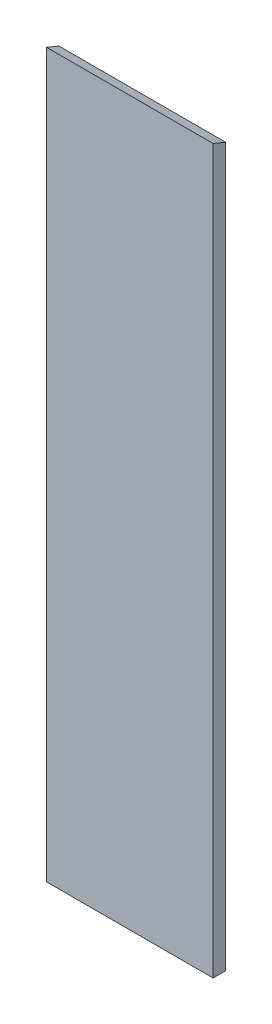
ISO-10303-21;
HEADER;
FILE_DESCRIPTION(('STEP AP214'),'2;1');
FILE_NAME('part.step','',(''),(''),'','','');
FILE_SCHEMA(('AUTOMOTIVE_DESIGN { 1 0 10303 214 1 1 1 1 }'));
ENDSEC;
DATA;
#1=APPLICATION_CONTEXT('core data for automotive mechanical design processes');
#2=APPLICATION_PROTOCOL_DEFINITION('international standard','automotive_design',2000,#1);
#3=PRODUCT_CONTEXT('',#1,'mechanical');
#4=PRODUCT('Part','Part','',(#3));
#5=PRODUCT_RELATED_PRODUCT_CATEGORY('part','',(#4));
#6=PRODUCT_DEFINITION_FORMATION('','',#4);
#7=PRODUCT_DEFINITION_CONTEXT('part definition',#1,'design');
#8=PRODUCT_DEFINITION('design','',#6,#7);
#9=PRODUCT_DEFINITION_SHAPE('','',#8);
#10=(LENGTH_UNIT() NAMED_UNIT(*) SI_UNIT(.MILLI.,.METRE.));
#11=(NAMED_UNIT(*) PLANE_ANGLE_UNIT() SI_UNIT($,.RADIAN.));
#12=(NAMED_UNIT(*) SI_UNIT($,.STERADIAN.) SOLID_ANGLE_UNIT());
#13=UNCERTAINTY_MEASURE_WITH_UNIT(LENGTH_MEASURE(1.E-05),#10,'distance_accuracy_value','');
#14=(GEOMETRIC_REPRESENTATION_CONTEXT(3) GLOBAL_UNCERTAINTY_ASSIGNED_CONTEXT((#13)) GLOBAL_UNIT_ASSIGNED_CONTEXT((#10,
#11,#12)) REPRESENTATION_CONTEXT('',''));
#15=CARTESIAN_POINT('',(0.,0.,0.));
#16=DIRECTION('',(0.,0.,1.));
#17=DIRECTION('',(1.,0.,0.));
#18=AXIS2_PLACEMENT_3D('',#15,#16,#17);
#19=CARTESIAN_POINT('',(100.,-433.58,14.9999999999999));
#20=DIRECTION('',(-1.,0.,0.));
#21=DIRECTION('',(0.,0.,1.));
#22=AXIS2_PLACEMENT_3D('',#19,#20,#21);
#23=PLANE('',#22);
#24=DIRECTION('',(0.,1.,0.));
#25=VECTOR('',#24,1.);
#26=CARTESIAN_POINT('',(100.,-433.58,0.));
#27=LINE('',#26,#25);
#28=CARTESIAN_POINT('',(100.,-433.58,0.));
#29=VERTEX_POINT('',#28);
#30=CARTESIAN_POINT('',(100.000000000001,427.366796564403,0.));
#31=VERTEX_POINT('',#30);
#32=EDGE_CURVE('E88',#29,#31,#27,.T.);
#33=ORIENTED_EDGE('',*,*,#32,.T.);
#34=DIRECTION('',(0.,-0.382683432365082,-0.92387953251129));
#35=VECTOR('',#34,1.);
#36=CARTESIAN_POINT('',(100.000000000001,433.58,14.9999999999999));
#37=LINE('',#36,#35);
#38=CARTESIAN_POINT('',(100.000000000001,433.58,14.9999999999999));
#39=VERTEX_POINT('',#38);
#40=EDGE_CURVE('E53',#39,#31,#37,.T.);
#41=ORIENTED_EDGE('',*,*,#40,.F.);
#42=DIRECTION('',(0.,1.,0.));
#43=VECTOR('',#42,1.);
#44=CARTESIAN_POINT('',(100.,-433.58,14.9999999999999));
#45=LINE('',#44,#43);
#46=CARTESIAN_POINT('',(100.,-433.58,14.9999999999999));
#47=VERTEX_POINT('',#46);
#48=EDGE_CURVE('E83',#47,#39,#45,.T.);
#49=ORIENTED_EDGE('',*,*,#48,.F.);
#50=DIRECTION('',(0.,0.,-1.));
#51=VECTOR('',#50,1.);
#52=CARTESIAN_POINT('',(100.,-433.58,14.9999999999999));
#53=LINE('',#52,#51);
#54=EDGE_CURVE('E46',#47,#29,#53,.T.);
#55=ORIENTED_EDGE('',*,*,#54,.T.);
#56=EDGE_LOOP('',(#33,#41,#49,#55));
#57=FACE_BOUND('',#56,.T.);
#58=ADVANCED_FACE('F38',(#57),#23,.F.);
#59=CARTESIAN_POINT('',(-100.,-433.58,14.9999999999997));
#60=DIRECTION('',(1.,0.,0.));
#61=DIRECTION('',(0.,0.,-1.));
#62=AXIS2_PLACEMENT_3D('',#59,#60,#61);
#63=PLANE('',#62);
#64=DIRECTION('',(0.,-1.,0.));
#65=VECTOR('',#64,1.);
#66=CARTESIAN_POINT('',(-100.,-433.58,14.9999999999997));
#67=LINE('',#66,#65);
#68=CARTESIAN_POINT('',(-100.,433.58,14.9999999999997));
#69=VERTEX_POINT('',#68);
#70=CARTESIAN_POINT('',(-100.,-433.58,14.9999999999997));
#71=VERTEX_POINT('',#70);
#72=EDGE_CURVE('E103',#69,#71,#67,.T.);
#73=ORIENTED_EDGE('',*,*,#72,.F.);
#74=DIRECTION('',(0.,-0.382683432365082,-0.92387953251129));
#75=VECTOR('',#74,1.);
#76=CARTESIAN_POINT('',(-100.,433.58,14.9999999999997));
#77=LINE('',#76,#75);
#78=CARTESIAN_POINT('',(-100.,427.366796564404,-3.33066907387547E-13));
#79=VERTEX_POINT('',#78);
#80=EDGE_CURVE('E98',#69,#79,#77,.T.);
#81=ORIENTED_EDGE('',*,*,#80,.T.);
#82=DIRECTION('',(0.,-1.,0.));
#83=VECTOR('',#82,1.);
#84=CARTESIAN_POINT('',(-100.000000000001,-433.58,-3.33066907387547E-13));
#85=LINE('',#84,#83);
#86=CARTESIAN_POINT('',(-100.000000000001,-433.58,-3.33066907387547E-13));
#87=VERTEX_POINT('',#86);
#88=EDGE_CURVE('E84',#79,#87,#85,.T.);
#89=ORIENTED_EDGE('',*,*,#88,.T.);
#90=DIRECTION('',(0.,0.,-1.));
#91=VECTOR('',#90,1.);
#92=CARTESIAN_POINT('',(-100.,-433.58,14.9999999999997));
#93=LINE('',#92,#91);
#94=EDGE_CURVE('E11',#71,#87,#93,.T.);
#95=ORIENTED_EDGE('',*,*,#94,.F.);
#96=EDGE_LOOP('',(#73,#81,#89,#95));
#97=FACE_BOUND('',#96,.T.);
#98=ADVANCED_FACE('F120',(#97),#63,.F.);
#99=CARTESIAN_POINT('',(-100.,-433.58,14.9999999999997));
#100=DIRECTION('',(0.,1.,0.));
#101=DIRECTION('',(0.,0.,1.));
#102=AXIS2_PLACEMENT_3D('',#99,#100,#101);
#103=PLANE('',#102);
#104=DIRECTION('',(1.,0.,0.));
#105=VECTOR('',#104,1.);
#106=CARTESIAN_POINT('',(-100.000000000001,-433.58,-3.33066907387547E-13));
#107=LINE('',#106,#105);
#108=EDGE_CURVE('E74',#87,#29,#107,.T.);
#109=ORIENTED_EDGE('',*,*,#108,.T.);
#110=ORIENTED_EDGE('',*,*,#54,.F.);
#111=DIRECTION('',(1.,0.,0.));
#112=VECTOR('',#111,1.);
#113=CARTESIAN_POINT('',(-100.,-433.58,14.9999999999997));
#114=LINE('',#113,#112);
#115=EDGE_CURVE('E62',#71,#47,#114,.T.);
#116=ORIENTED_EDGE('',*,*,#115,.F.);
#117=ORIENTED_EDGE('',*,*,#94,.T.);
#118=EDGE_LOOP('',(#109,#110,#116,#117));
#119=FACE_BOUND('',#118,.T.);
#120=ADVANCED_FACE('F76',(#119),#103,.F.);
#121=CARTESIAN_POINT('',(0.,0.,15.));
#122=DIRECTION('',(0.,0.,-1.));
#123=DIRECTION('',(-1.,0.,0.));
#124=AXIS2_PLACEMENT_3D('',#121,#122,#123);
#125=PLANE('',#124);
#126=ORIENTED_EDGE('',*,*,#48,.T.);
#127=DIRECTION('',(-1.,0.,0.));
#128=VECTOR('',#127,1.);
#129=CARTESIAN_POINT('',(-100.,433.58,14.9999999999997));
#130=LINE('',#129,#128);
#131=EDGE_CURVE('E106',#39,#69,#130,.T.);
#132=ORIENTED_EDGE('',*,*,#131,.T.);
#133=ORIENTED_EDGE('',*,*,#72,.T.);
#134=ORIENTED_EDGE('',*,*,#115,.T.);
#135=EDGE_LOOP('',(#126,#132,#133,#134));
#136=FACE_BOUND('',#135,.T.);
#137=ADVANCED_FACE('F126',(#136),#125,.F.);
#138=CARTESIAN_POINT('',(0.,0.,0.));
#139=DIRECTION('',(0.,0.,-1.));
#140=DIRECTION('',(-1.,0.,0.));
#141=AXIS2_PLACEMENT_3D('',#138,#139,#140);
#142=PLANE('',#141);
#143=DIRECTION('',(1.,0.,0.));
#144=VECTOR('',#143,1.);
#145=CARTESIAN_POINT('',(-100.,427.366796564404,-3.33066907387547E-13));
#146=LINE('',#145,#144);
#147=EDGE_CURVE('E91',#79,#31,#146,.T.);
#148=ORIENTED_EDGE('',*,*,#147,.T.);
#149=ORIENTED_EDGE('',*,*,#32,.F.);
#150=ORIENTED_EDGE('',*,*,#108,.F.);
#151=ORIENTED_EDGE('',*,*,#88,.F.);
#152=EDGE_LOOP('',(#148,#149,#150,#151));
#153=FACE_BOUND('',#152,.T.);
#154=ADVANCED_FACE('F90',(#153),#142,.T.);
#155=CARTESIAN_POINT('',(-100.,433.58,14.9999999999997));
#156=DIRECTION('',(0.,-0.92387953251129,0.382683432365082));
#157=DIRECTION('',(0.,-0.382683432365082,-0.92387953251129));
#158=AXIS2_PLACEMENT_3D('',#155,#156,#157);
#159=PLANE('',#158);
#160=ORIENTED_EDGE('',*,*,#40,.T.);
#161=ORIENTED_EDGE('',*,*,#147,.F.);
#162=ORIENTED_EDGE('',*,*,#80,.F.);
#163=ORIENTED_EDGE('',*,*,#131,.F.);
#164=EDGE_LOOP('',(#160,#161,#162,#163));
#165=FACE_BOUND('',#164,.T.);
#166=ADVANCED_FACE('F123',(#165),#159,.F.);
#167=CLOSED_SHELL('',(#58,#98,#120,#137,#154,#166));
#168=MANIFOLD_SOLID_BREP('B2',#167);
#169=ADVANCED_BREP_SHAPE_REPRESENTATION('',(#18,#168),#14);
#170=SHAPE_DEFINITION_REPRESENTATION(#9,#169);
ENDSEC;
END-ISO-10303-21;
